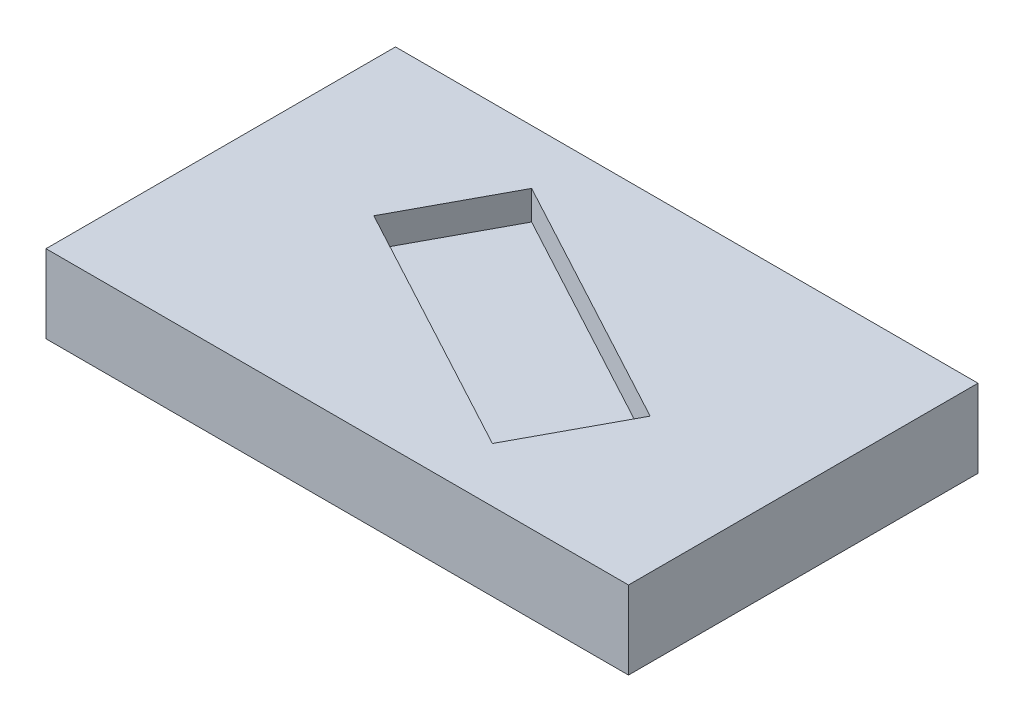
from build123d import *

# Parameters (mm, degrees)
SKETCH1_W          = 127
SKETCH1_H          = 76.2
EXTRUDE1_DEPTH     = 17.018
CUT_EXTRUDE1_DEPTH = 6.35


with BuildPart() as part:
    # Sketch1 → Extrude1 (new body)
    with BuildSketch(Plane(origin=(0, 0, 0), x_dir=(1, 0, 0), z_dir=(0, 1, 0))):
        Rectangle(SKETCH1_W, SKETCH1_H)
    extrude(amount=EXTRUDE1_DEPTH)

    # Sketch2 → Cut-Extrude1 (cut)
    with BuildSketch(Plane(origin=(0, 17.018, 0), x_dir=(-1, 0, 0), z_dir=(0, 1, 0))):
        Polygon((21.946356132, -26.224224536), (-33.977861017, 3.854537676), (-21.946356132, 26.224224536), (33.977861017, -3.854537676), align=None)
    extrude(amount=-CUT_EXTRUDE1_DEPTH, mode=Mode.SUBTRACT)


solid = part.part
